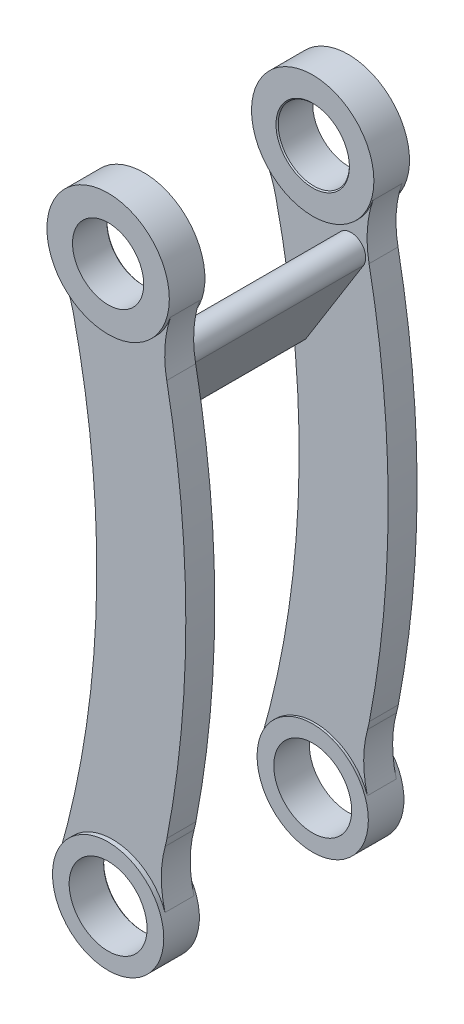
ISO-10303-21;
HEADER;
FILE_DESCRIPTION(('STEP AP214'),'2;1');
FILE_NAME('part.step','',(''),(''),'','','');
FILE_SCHEMA(('AUTOMOTIVE_DESIGN { 1 0 10303 214 1 1 1 1 }'));
ENDSEC;
DATA;
#1=APPLICATION_CONTEXT('core data for automotive mechanical design processes');
#2=APPLICATION_PROTOCOL_DEFINITION('international standard','automotive_design',2000,#1);
#3=PRODUCT_CONTEXT('',#1,'mechanical');
#4=PRODUCT('Part','Part','',(#3));
#5=PRODUCT_RELATED_PRODUCT_CATEGORY('part','',(#4));
#6=PRODUCT_DEFINITION_FORMATION('','',#4);
#7=PRODUCT_DEFINITION_CONTEXT('part definition',#1,'design');
#8=PRODUCT_DEFINITION('design','',#6,#7);
#9=PRODUCT_DEFINITION_SHAPE('','',#8);
#10=(LENGTH_UNIT() NAMED_UNIT(*) SI_UNIT(.MILLI.,.METRE.));
#11=(NAMED_UNIT(*) PLANE_ANGLE_UNIT() SI_UNIT($,.RADIAN.));
#12=(NAMED_UNIT(*) SI_UNIT($,.STERADIAN.) SOLID_ANGLE_UNIT());
#13=UNCERTAINTY_MEASURE_WITH_UNIT(LENGTH_MEASURE(1.E-05),#10,'distance_accuracy_value','');
#14=(GEOMETRIC_REPRESENTATION_CONTEXT(3) GLOBAL_UNCERTAINTY_ASSIGNED_CONTEXT((#13)) GLOBAL_UNIT_ASSIGNED_CONTEXT((#10,
#11,#12)) REPRESENTATION_CONTEXT('',''));
#15=CARTESIAN_POINT('',(0.,0.,0.));
#16=DIRECTION('',(0.,0.,1.));
#17=DIRECTION('',(1.,0.,0.));
#18=AXIS2_PLACEMENT_3D('',#15,#16,#17);
#19=CARTESIAN_POINT('',(-251.75789418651,98.2298007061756,103.92));
#20=DIRECTION('',(0.,0.,1.));
#21=DIRECTION('',(1.,0.,0.));
#22=AXIS2_PLACEMENT_3D('',#19,#20,#21);
#23=PLANE('',#22);
#24=CARTESIAN_POINT('',(-437.093638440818,56.3888888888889,103.92));
#25=DIRECTION('',(0.,0.,-1.));
#26=DIRECTION('',(1.,0.,0.));
#27=AXIS2_PLACEMENT_3D('',#24,#25,#26);
#28=CIRCLE('',#27,430.);
#29=CARTESIAN_POINT('',(-17.6495856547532,151.08147879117,103.92));
#30=VERTEX_POINT('',#29);
#31=CARTESIAN_POINT('',(-24.0161339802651,-63.0555555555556,103.92));
#32=VERTEX_POINT('',#31);
#33=EDGE_CURVE('E180',#30,#32,#28,.T.);
#34=ORIENTED_EDGE('',*,*,#33,.T.);
#35=CARTESIAN_POINT('',(-4.44089209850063E-13,-70.,103.92));
#36=DIRECTION('',(0.,0.,1.));
#37=DIRECTION('',(1.,0.,0.));
#38=AXIS2_PLACEMENT_3D('',#35,#36,#37);
#39=CIRCLE('',#38,25.);
#40=CARTESIAN_POINT('',(23.575093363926,-61.6804463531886,103.92));
#41=VERTEX_POINT('',#40);
#42=EDGE_CURVE('E187',#41,#32,#39,.T.);
#43=ORIENTED_EDGE('',*,*,#42,.F.);
#44=CARTESIAN_POINT('',(71.9167906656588,-48.9101565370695,103.92));
#45=DIRECTION('',(0.,0.,-1.));
#46=DIRECTION('',(1.,0.,0.));
#47=AXIS2_PLACEMENT_3D('',#44,#45,#46);
#48=CIRCLE('',#47,50.);
#49=CARTESIAN_POINT('',(23.6300135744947,-35.9337487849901,103.92));
#50=VERTEX_POINT('',#49);
#51=EDGE_CURVE('E169',#41,#50,#48,.T.);
#52=ORIENTED_EDGE('',*,*,#51,.T.);
#53=CARTESIAN_POINT('',(-24.6567635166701,-22.9573410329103,103.92));
#54=DIRECTION('',(0.,0.,1.));
#55=DIRECTION('',(1.,0.,0.));
#56=AXIS2_PLACEMENT_3D('',#53,#54,#55);
#57=CIRCLE('',#56,50.);
#58=CARTESIAN_POINT('',(24.4428644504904,-32.4033207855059,103.92));
#59=VERTEX_POINT('',#58);
#60=EDGE_CURVE('E179',#50,#59,#57,.T.);
#61=ORIENTED_EDGE('',*,*,#60,.T.);
#62=CARTESIAN_POINT('',(-437.093638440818,56.3888888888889,103.92));
#63=DIRECTION('',(0.,0.,1.));
#64=DIRECTION('',(1.,0.,0.));
#65=AXIS2_PLACEMENT_3D('',#62,#63,#64);
#66=CIRCLE('',#65,470.);
#67=CARTESIAN_POINT('',(24.3406091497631,145.710975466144,103.92));
#68=VERTEX_POINT('',#67);
#69=EDGE_CURVE('E229',#59,#68,#66,.T.);
#70=ORIENTED_EDGE('',*,*,#69,.T.);
#71=CARTESIAN_POINT('',(73.4293588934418,155.213325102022,103.92));
#72=DIRECTION('',(0.,0.,-1.));
#73=DIRECTION('',(-1.,0.,0.));
#74=AXIS2_PLACEMENT_3D('',#71,#72,#73);
#75=CIRCLE('',#74,50.);
#76=CARTESIAN_POINT('',(26.0555789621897,171.204728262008,103.92));
#77=VERTEX_POINT('',#76);
#78=EDGE_CURVE('E219',#68,#77,#75,.T.);
#79=ORIENTED_EDGE('',*,*,#78,.T.);
#80=CARTESIAN_POINT('',(0.,180.,103.92));
#81=DIRECTION('',(0.,0.,1.));
#82=DIRECTION('',(1.,0.,0.));
#83=AXIS2_PLACEMENT_3D('',#80,#81,#82);
#84=CIRCLE('',#83,27.5);
#85=CARTESIAN_POINT('',(-23.5691499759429,165.831543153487,103.92));
#86=VERTEX_POINT('',#85);
#87=EDGE_CURVE('E197',#86,#77,#84,.T.);
#88=ORIENTED_EDGE('',*,*,#87,.F.);
#89=CARTESIAN_POINT('',(-66.4221499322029,140.070712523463,103.92));
#90=DIRECTION('',(0.,0.,-1.));
#91=DIRECTION('',(1.,0.,0.));
#92=AXIS2_PLACEMENT_3D('',#89,#90,#91);
#93=CIRCLE('',#92,50.);
#94=EDGE_CURVE('E216',#86,#30,#93,.T.);
#95=ORIENTED_EDGE('',*,*,#94,.T.);
#96=EDGE_LOOP('',(#34,#43,#52,#61,#70,#79,#88,#95));
#97=FACE_BOUND('',#96,.T.);
#98=ADVANCED_FACE('F32',(#97),#23,.T.);
#99=CARTESIAN_POINT('',(-251.75789418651,98.2298007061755,90.9200000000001));
#100=DIRECTION('',(0.,0.,1.));
#101=DIRECTION('',(1.,0.,0.));
#102=AXIS2_PLACEMENT_3D('',#99,#100,#101);
#103=PLANE('',#102);
#104=DIRECTION('',(-0.400474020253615,-0.916308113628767,0.));
#105=VECTOR('',#104,1.);
#106=CARTESIAN_POINT('',(10.232997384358,149.874023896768,90.9200000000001));
#107=LINE('',#106,#105);
#108=CARTESIAN_POINT('',(10.232997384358,149.874023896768,90.9200000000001));
#109=VERTEX_POINT('',#108);
#110=CARTESIAN_POINT('',(-9.3186853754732,105.138623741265,90.9200000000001));
#111=VERTEX_POINT('',#110);
#112=EDGE_CURVE('E523',#109,#111,#107,.T.);
#113=ORIENTED_EDGE('',*,*,#112,.T.);
#114=CARTESIAN_POINT('',(-6.56976103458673,103.937201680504,90.9199999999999));
#115=DIRECTION('',(0.,0.,1.));
#116=DIRECTION('',(-1.,0.,0.));
#117=AXIS2_PLACEMENT_3D('',#114,#115,#116);
#118=CIRCLE('',#117,3.00000000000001);
#119=CARTESIAN_POINT('',(-4.02475261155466,102.34882762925,90.92));
#120=VERTEX_POINT('',#119);
#121=EDGE_CURVE('E514',#111,#120,#118,.T.);
#122=ORIENTED_EDGE('',*,*,#121,.T.);
#123=DIRECTION('',(0.529458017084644,0.848336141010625,0.));
#124=VECTOR('',#123,1.);
#125=CARTESIAN_POINT('',(21.8241031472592,143.765744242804,90.9200000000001));
#126=LINE('',#125,#124);
#127=CARTESIAN_POINT('',(21.8241031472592,143.765744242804,90.9200000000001));
#128=VERTEX_POINT('',#127);
#129=EDGE_CURVE('E517',#120,#128,#126,.T.);
#130=ORIENTED_EDGE('',*,*,#129,.T.);
#131=CARTESIAN_POINT('',(16.2517879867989,147.243501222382,90.9200000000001));
#132=DIRECTION('',(0.,0.,1.));
#133=DIRECTION('',(1.,0.,0.));
#134=AXIS2_PLACEMENT_3D('',#131,#132,#133);
#135=CIRCLE('',#134,6.56852265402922);
#136=EDGE_CURVE('E520',#128,#109,#135,.T.);
#137=ORIENTED_EDGE('',*,*,#136,.T.);
#138=EDGE_LOOP('',(#113,#122,#130,#137));
#139=FACE_BOUND('',#138,.T.);
#140=CARTESIAN_POINT('',(-4.44089209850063E-13,-70.,90.9200000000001));
#141=DIRECTION('',(0.,0.,-1.));
#142=DIRECTION('',(-1.,0.,0.));
#143=AXIS2_PLACEMENT_3D('',#140,#141,#142);
#144=CIRCLE('',#143,25.);
#145=CARTESIAN_POINT('',(-24.0161339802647,-63.0555555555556,90.9199999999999));
#146=VERTEX_POINT('',#145);
#147=CARTESIAN_POINT('',(23.5750933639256,-61.6804463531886,90.9200000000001));
#148=VERTEX_POINT('',#147);
#149=EDGE_CURVE('E188',#146,#148,#144,.T.);
#150=ORIENTED_EDGE('',*,*,#149,.F.);
#151=CARTESIAN_POINT('',(-437.093638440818,56.388888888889,90.9200000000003));
#152=DIRECTION('',(0.,0.,-1.));
#153=DIRECTION('',(1.,0.,0.));
#154=AXIS2_PLACEMENT_3D('',#151,#152,#153);
#155=CIRCLE('',#154,430.);
#156=CARTESIAN_POINT('',(-17.6495856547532,151.081478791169,90.92));
#157=VERTEX_POINT('',#156);
#158=EDGE_CURVE('E549',#157,#146,#155,.T.);
#159=ORIENTED_EDGE('',*,*,#158,.F.);
#160=CARTESIAN_POINT('',(-66.4221499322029,140.070712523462,90.9200000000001));
#161=DIRECTION('',(0.,0.,-1.));
#162=DIRECTION('',(1.,0.,0.));
#163=AXIS2_PLACEMENT_3D('',#160,#161,#162);
#164=CIRCLE('',#163,50.);
#165=CARTESIAN_POINT('',(-23.5691499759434,165.831543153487,90.9199999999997));
#166=VERTEX_POINT('',#165);
#167=EDGE_CURVE('E570',#166,#157,#164,.T.);
#168=ORIENTED_EDGE('',*,*,#167,.F.);
#169=CARTESIAN_POINT('',(-2.22044604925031E-13,180.,90.92));
#170=DIRECTION('',(0.,0.,-1.));
#171=DIRECTION('',(-1.,0.,0.));
#172=AXIS2_PLACEMENT_3D('',#169,#170,#171);
#173=CIRCLE('',#172,27.5);
#174=CARTESIAN_POINT('',(26.0555789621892,171.204728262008,90.9199999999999));
#175=VERTEX_POINT('',#174);
#176=EDGE_CURVE('E560',#175,#166,#173,.T.);
#177=ORIENTED_EDGE('',*,*,#176,.F.);
#178=CARTESIAN_POINT('',(73.429358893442,155.213325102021,90.9200000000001));
#179=DIRECTION('',(0.,0.,-1.));
#180=DIRECTION('',(-1.,0.,0.));
#181=AXIS2_PLACEMENT_3D('',#178,#179,#180);
#182=CIRCLE('',#181,50.);
#183=CARTESIAN_POINT('',(24.3406091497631,145.710975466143,90.9200000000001));
#184=VERTEX_POINT('',#183);
#185=EDGE_CURVE('E567',#184,#175,#182,.T.);
#186=ORIENTED_EDGE('',*,*,#185,.F.);
#187=CARTESIAN_POINT('',(-437.093638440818,56.388888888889,90.9200000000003));
#188=DIRECTION('',(0.,0.,1.));
#189=DIRECTION('',(1.,0.,0.));
#190=AXIS2_PLACEMENT_3D('',#187,#188,#189);
#191=CIRCLE('',#190,470.);
#192=CARTESIAN_POINT('',(24.4428644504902,-32.4033207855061,90.92));
#193=VERTEX_POINT('',#192);
#194=EDGE_CURVE('E565',#193,#184,#191,.T.);
#195=ORIENTED_EDGE('',*,*,#194,.F.);
#196=CARTESIAN_POINT('',(-24.6567635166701,-22.9573410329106,90.9200000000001));
#197=DIRECTION('',(0.,0.,1.));
#198=DIRECTION('',(1.,0.,0.));
#199=AXIS2_PLACEMENT_3D('',#196,#197,#198);
#200=CIRCLE('',#199,50.);
#201=CARTESIAN_POINT('',(23.6300135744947,-35.93374878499,90.9200000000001));
#202=VERTEX_POINT('',#201);
#203=EDGE_CURVE('E557',#202,#193,#200,.T.);
#204=ORIENTED_EDGE('',*,*,#203,.F.);
#205=CARTESIAN_POINT('',(71.9167906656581,-48.9101565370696,90.9200000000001));
#206=DIRECTION('',(0.,0.,-1.));
#207=DIRECTION('',(1.,0.,0.));
#208=AXIS2_PLACEMENT_3D('',#205,#206,#207);
#209=CIRCLE('',#208,50.);
#210=EDGE_CURVE('E551',#148,#202,#209,.T.);
#211=ORIENTED_EDGE('',*,*,#210,.F.);
#212=EDGE_LOOP('',(#150,#159,#168,#177,#186,#195,#204,#211));
#213=FACE_BOUND('',#212,.T.);
#214=ADVANCED_FACE('F261',(#139,#213),#103,.F.);
#215=CARTESIAN_POINT('',(-251.757894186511,98.2298007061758,12.9999999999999));
#216=DIRECTION('',(0.,0.,1.));
#217=DIRECTION('',(1.,0.,0.));
#218=AXIS2_PLACEMENT_3D('',#215,#216,#217);
#219=PLANE('',#218);
#220=CARTESIAN_POINT('',(-437.093638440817,56.3888888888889,13.));
#221=DIRECTION('',(0.,0.,-1.));
#222=DIRECTION('',(1.,0.,0.));
#223=AXIS2_PLACEMENT_3D('',#220,#221,#222);
#224=CIRCLE('',#223,430.);
#225=CARTESIAN_POINT('',(-17.6495856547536,151.08147879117,13.0000000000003));
#226=VERTEX_POINT('',#225);
#227=CARTESIAN_POINT('',(-24.0161339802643,-63.0555555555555,12.9999999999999));
#228=VERTEX_POINT('',#227);
#229=EDGE_CURVE('E476',#226,#228,#224,.T.);
#230=ORIENTED_EDGE('',*,*,#229,.T.);
#231=CARTESIAN_POINT('',(0.,-70.0000000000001,12.9999999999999));
#232=DIRECTION('',(0.,0.,1.));
#233=DIRECTION('',(1.,0.,0.));
#234=AXIS2_PLACEMENT_3D('',#231,#232,#233);
#235=CIRCLE('',#234,25.);
#236=CARTESIAN_POINT('',(23.575093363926,-61.6804463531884,13.0000000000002));
#237=VERTEX_POINT('',#236);
#238=EDGE_CURVE('E389',#237,#228,#235,.T.);
#239=ORIENTED_EDGE('',*,*,#238,.F.);
#240=CARTESIAN_POINT('',(71.9167906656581,-48.9101565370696,13.0000000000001));
#241=DIRECTION('',(0.,0.,-1.));
#242=DIRECTION('',(1.,0.,0.));
#243=AXIS2_PLACEMENT_3D('',#240,#241,#242);
#244=CIRCLE('',#243,50.);
#245=CARTESIAN_POINT('',(23.6300135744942,-35.93374878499,13.0000000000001));
#246=VERTEX_POINT('',#245);
#247=EDGE_CURVE('E474',#237,#246,#244,.T.);
#248=ORIENTED_EDGE('',*,*,#247,.T.);
#249=CARTESIAN_POINT('',(-24.6567635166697,-22.9573410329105,13.0000000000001));
#250=DIRECTION('',(0.,0.,1.));
#251=DIRECTION('',(1.,0.,0.));
#252=AXIS2_PLACEMENT_3D('',#249,#250,#251);
#253=CIRCLE('',#252,50.);
#254=CARTESIAN_POINT('',(24.4428644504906,-32.403320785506,13.));
#255=VERTEX_POINT('',#254);
#256=EDGE_CURVE('E472',#246,#255,#253,.T.);
#257=ORIENTED_EDGE('',*,*,#256,.T.);
#258=CARTESIAN_POINT('',(-437.093638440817,56.3888888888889,13.));
#259=DIRECTION('',(0.,0.,1.));
#260=DIRECTION('',(1.,0.,0.));
#261=AXIS2_PLACEMENT_3D('',#258,#259,#260);
#262=CIRCLE('',#261,470.);
#263=CARTESIAN_POINT('',(24.3406091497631,145.710975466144,13.0000000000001));
#264=VERTEX_POINT('',#263);
#265=EDGE_CURVE('E455',#255,#264,#262,.T.);
#266=ORIENTED_EDGE('',*,*,#265,.T.);
#267=CARTESIAN_POINT('',(73.429358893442,155.213325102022,13.0000000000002));
#268=DIRECTION('',(0.,0.,-1.));
#269=DIRECTION('',(-1.,0.,0.));
#270=AXIS2_PLACEMENT_3D('',#267,#268,#269);
#271=CIRCLE('',#270,50.);
#272=CARTESIAN_POINT('',(26.0555789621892,171.204728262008,12.9999999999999));
#273=VERTEX_POINT('',#272);
#274=EDGE_CURVE('E445',#264,#273,#271,.T.);
#275=ORIENTED_EDGE('',*,*,#274,.T.);
#276=CARTESIAN_POINT('',(-4.44089209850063E-13,180.,13.));
#277=DIRECTION('',(0.,0.,1.));
#278=DIRECTION('',(1.,0.,0.));
#279=AXIS2_PLACEMENT_3D('',#276,#277,#278);
#280=CIRCLE('',#279,27.5);
#281=CARTESIAN_POINT('',(-23.5691499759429,165.831543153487,13.0000000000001));
#282=VERTEX_POINT('',#281);
#283=EDGE_CURVE('E432',#282,#273,#280,.T.);
#284=ORIENTED_EDGE('',*,*,#283,.F.);
#285=CARTESIAN_POINT('',(-66.4221499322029,140.070712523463,12.9999999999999));
#286=DIRECTION('',(0.,0.,-1.));
#287=DIRECTION('',(1.,0.,0.));
#288=AXIS2_PLACEMENT_3D('',#285,#286,#287);
#289=CIRCLE('',#288,50.);
#290=EDGE_CURVE('E55',#282,#226,#289,.T.);
#291=ORIENTED_EDGE('',*,*,#290,.T.);
#292=EDGE_LOOP('',(#230,#239,#248,#257,#266,#275,#284,#291));
#293=FACE_BOUND('',#292,.T.);
#294=DIRECTION('',(0.529458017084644,0.848336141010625,0.));
#295=VECTOR('',#294,1.);
#296=CARTESIAN_POINT('',(21.8241031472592,143.765744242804,13.0000000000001));
#297=LINE('',#296,#295);
#298=CARTESIAN_POINT('',(-4.02475261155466,102.34882762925,12.9999999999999));
#299=VERTEX_POINT('',#298);
#300=CARTESIAN_POINT('',(21.8241031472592,143.765744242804,13.0000000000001));
#301=VERTEX_POINT('',#300);
#302=EDGE_CURVE('E501',#299,#301,#297,.T.);
#303=ORIENTED_EDGE('',*,*,#302,.F.);
#304=CARTESIAN_POINT('',(-6.56976103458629,103.937201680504,13.));
#305=DIRECTION('',(0.,0.,1.));
#306=DIRECTION('',(-1.,0.,0.));
#307=AXIS2_PLACEMENT_3D('',#304,#305,#306);
#308=CIRCLE('',#307,3.00000000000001);
#309=CARTESIAN_POINT('',(-9.31868537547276,105.138623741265,13.0000000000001));
#310=VERTEX_POINT('',#309);
#311=EDGE_CURVE('E504',#310,#299,#308,.T.);
#312=ORIENTED_EDGE('',*,*,#311,.F.);
#313=DIRECTION('',(-0.400474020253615,-0.916308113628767,0.));
#314=VECTOR('',#313,1.);
#315=CARTESIAN_POINT('',(10.2329973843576,149.874023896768,13.0000000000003));
#316=LINE('',#315,#314);
#317=CARTESIAN_POINT('',(10.2329973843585,149.874023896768,13.0000000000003));
#318=VERTEX_POINT('',#317);
#319=EDGE_CURVE('E508',#318,#310,#316,.T.);
#320=ORIENTED_EDGE('',*,*,#319,.F.);
#321=CARTESIAN_POINT('',(16.2517879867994,147.243501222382,13.0000000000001));
#322=DIRECTION('',(0.,0.,1.));
#323=DIRECTION('',(1.,0.,0.));
#324=AXIS2_PLACEMENT_3D('',#321,#322,#323);
#325=CIRCLE('',#324,6.56852265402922);
#326=EDGE_CURVE('E505',#301,#318,#325,.T.);
#327=ORIENTED_EDGE('',*,*,#326,.F.);
#328=EDGE_LOOP('',(#303,#312,#320,#327));
#329=FACE_BOUND('',#328,.T.);
#330=ADVANCED_FACE('F266',(#293,#329),#219,.T.);
#331=CARTESIAN_POINT('',(-251.757894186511,98.2298007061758,0.));
#332=DIRECTION('',(0.,0.,1.));
#333=DIRECTION('',(1.,0.,0.));
#334=AXIS2_PLACEMENT_3D('',#331,#332,#333);
#335=PLANE('',#334);
#336=CARTESIAN_POINT('',(0.,180.,0.));
#337=DIRECTION('',(0.,0.,-1.));
#338=DIRECTION('',(-1.,0.,0.));
#339=AXIS2_PLACEMENT_3D('',#336,#337,#338);
#340=CIRCLE('',#339,27.5);
#341=CARTESIAN_POINT('',(26.0555789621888,171.204728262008,0.));
#342=VERTEX_POINT('',#341);
#343=CARTESIAN_POINT('',(-23.5691499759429,165.831543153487,2.22044604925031E-13));
#344=VERTEX_POINT('',#343);
#345=EDGE_CURVE('E491',#342,#344,#340,.T.);
#346=ORIENTED_EDGE('',*,*,#345,.F.);
#347=CARTESIAN_POINT('',(73.429358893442,155.213325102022,0.));
#348=DIRECTION('',(0.,0.,-1.));
#349=DIRECTION('',(-1.,0.,0.));
#350=AXIS2_PLACEMENT_3D('',#347,#348,#349);
#351=CIRCLE('',#350,50.);
#352=CARTESIAN_POINT('',(24.3406091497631,145.710975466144,0.));
#353=VERTEX_POINT('',#352);
#354=EDGE_CURVE('E480',#353,#342,#351,.T.);
#355=ORIENTED_EDGE('',*,*,#354,.F.);
#356=CARTESIAN_POINT('',(-437.093638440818,56.3888888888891,1.11022302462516E-13));
#357=DIRECTION('',(0.,0.,1.));
#358=DIRECTION('',(1.,0.,0.));
#359=AXIS2_PLACEMENT_3D('',#356,#357,#358);
#360=CIRCLE('',#359,470.);
#361=CARTESIAN_POINT('',(24.4428644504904,-32.4033207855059,0.));
#362=VERTEX_POINT('',#361);
#363=EDGE_CURVE('E481',#362,#353,#360,.T.);
#364=ORIENTED_EDGE('',*,*,#363,.F.);
#365=CARTESIAN_POINT('',(-24.6567635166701,-22.9573410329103,0.));
#366=DIRECTION('',(0.,0.,1.));
#367=DIRECTION('',(1.,0.,0.));
#368=AXIS2_PLACEMENT_3D('',#365,#366,#367);
#369=CIRCLE('',#368,50.);
#370=CARTESIAN_POINT('',(23.630013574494,-35.9337487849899,0.));
#371=VERTEX_POINT('',#370);
#372=EDGE_CURVE('E412',#371,#362,#369,.T.);
#373=ORIENTED_EDGE('',*,*,#372,.F.);
#374=CARTESIAN_POINT('',(71.9167906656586,-48.9101565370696,1.11022302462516E-13));
#375=DIRECTION('',(0.,0.,-1.));
#376=DIRECTION('',(1.,0.,0.));
#377=AXIS2_PLACEMENT_3D('',#374,#375,#376);
#378=CIRCLE('',#377,50.);
#379=CARTESIAN_POINT('',(23.575093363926,-61.6804463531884,0.));
#380=VERTEX_POINT('',#379);
#381=EDGE_CURVE('E410',#380,#371,#378,.T.);
#382=ORIENTED_EDGE('',*,*,#381,.F.);
#383=CARTESIAN_POINT('',(-4.44089209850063E-13,-70.0000000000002,0.));
#384=DIRECTION('',(0.,0.,-1.));
#385=DIRECTION('',(-1.,0.,0.));
#386=AXIS2_PLACEMENT_3D('',#383,#384,#385);
#387=CIRCLE('',#386,25.);
#388=CARTESIAN_POINT('',(-24.0161339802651,-63.0555555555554,1.11022302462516E-13));
#389=VERTEX_POINT('',#388);
#390=EDGE_CURVE('E390',#389,#380,#387,.T.);
#391=ORIENTED_EDGE('',*,*,#390,.F.);
#392=CARTESIAN_POINT('',(-437.093638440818,56.3888888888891,1.11022302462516E-13));
#393=DIRECTION('',(0.,0.,-1.));
#394=DIRECTION('',(1.,0.,0.));
#395=AXIS2_PLACEMENT_3D('',#392,#393,#394);
#396=CIRCLE('',#395,430.);
#397=CARTESIAN_POINT('',(-17.6495856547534,151.08147879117,2.22044604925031E-13));
#398=VERTEX_POINT('',#397);
#399=EDGE_CURVE('E413',#398,#389,#396,.T.);
#400=ORIENTED_EDGE('',*,*,#399,.F.);
#401=CARTESIAN_POINT('',(-66.4221499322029,140.070712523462,0.));
#402=DIRECTION('',(0.,0.,-1.));
#403=DIRECTION('',(1.,0.,0.));
#404=AXIS2_PLACEMENT_3D('',#401,#402,#403);
#405=CIRCLE('',#404,50.);
#406=EDGE_CURVE('E478',#344,#398,#405,.T.);
#407=ORIENTED_EDGE('',*,*,#406,.F.);
#408=EDGE_LOOP('',(#346,#355,#364,#373,#382,#391,#400,#407));
#409=FACE_BOUND('',#408,.T.);
#410=ADVANCED_FACE('F340',(#409),#335,.F.);
#411=CARTESIAN_POINT('',(-437.093638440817,56.3888888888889,13.));
#412=DIRECTION('',(0.,0.,-1.));
#413=DIRECTION('',(-1.,0.,0.));
#414=AXIS2_PLACEMENT_3D('',#411,#412,#413);
#415=CYLINDRICAL_SURFACE('',#414,430.);
#416=ORIENTED_EDGE('',*,*,#399,.T.);
#417=DIRECTION('',(0.,0.,-1.));
#418=VECTOR('',#417,1.);
#419=CARTESIAN_POINT('',(-24.0161339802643,-63.0555555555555,12.9999999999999));
#420=LINE('',#419,#418);
#421=EDGE_CURVE('E379',#228,#389,#420,.T.);
#422=ORIENTED_EDGE('',*,*,#421,.F.);
#423=ORIENTED_EDGE('',*,*,#229,.F.);
#424=DIRECTION('',(0.,0.,-1.));
#425=VECTOR('',#424,1.);
#426=CARTESIAN_POINT('',(-17.6495856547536,151.08147879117,13.0000000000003));
#427=LINE('',#426,#425);
#428=EDGE_CURVE('E444',#226,#398,#427,.T.);
#429=ORIENTED_EDGE('',*,*,#428,.T.);
#430=EDGE_LOOP('',(#416,#422,#423,#429));
#431=FACE_BOUND('',#430,.T.);
#432=ADVANCED_FACE('F34',(#431),#415,.F.);
#433=CARTESIAN_POINT('',(0.,-70.0000000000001,12.9999999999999));
#434=DIRECTION('',(0.,0.,-1.));
#435=DIRECTION('',(-1.,0.,0.));
#436=AXIS2_PLACEMENT_3D('',#433,#434,#435);
#437=CYLINDRICAL_SURFACE('',#436,25.);
#438=ORIENTED_EDGE('',*,*,#421,.T.);
#439=ORIENTED_EDGE('',*,*,#390,.T.);
#440=DIRECTION('',(0.,0.,-1.));
#441=VECTOR('',#440,1.);
#442=CARTESIAN_POINT('',(23.575093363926,-61.6804463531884,13.0000000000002));
#443=LINE('',#442,#441);
#444=EDGE_CURVE('E404',#237,#380,#443,.T.);
#445=ORIENTED_EDGE('',*,*,#444,.F.);
#446=ORIENTED_EDGE('',*,*,#238,.T.);
#447=EDGE_LOOP('',(#438,#439,#445,#446));
#448=FACE_BOUND('',#447,.T.);
#449=CARTESIAN_POINT('',(0.,-70.0000000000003,14.));
#450=DIRECTION('',(0.,0.,1.));
#451=DIRECTION('',(1.,0.,0.));
#452=AXIS2_PLACEMENT_3D('',#449,#450,#451);
#453=CIRCLE('',#452,25.);
#454=CARTESIAN_POINT('',(25.0000000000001,-70.0000000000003,14.));
#455=VERTEX_POINT('',#454);
#456=EDGE_CURVE('E384',#455,#455,#453,.T.);
#457=ORIENTED_EDGE('',*,*,#456,.F.);
#458=EDGE_LOOP('',(#457));
#459=FACE_BOUND('',#458,.T.);
#460=CARTESIAN_POINT('',(0.,-70.0000000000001,-2.));
#461=DIRECTION('',(0.,0.,-1.));
#462=DIRECTION('',(-1.,0.,0.));
#463=AXIS2_PLACEMENT_3D('',#460,#461,#462);
#464=CIRCLE('',#463,25.);
#465=CARTESIAN_POINT('',(-25.0000000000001,-70.0000000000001,-2.));
#466=VERTEX_POINT('',#465);
#467=EDGE_CURVE('E387',#466,#466,#464,.T.);
#468=ORIENTED_EDGE('',*,*,#467,.F.);
#469=EDGE_LOOP('',(#468));
#470=FACE_BOUND('',#469,.T.);
#471=ADVANCED_FACE('F367',(#448,#459,#470),#437,.T.);
#472=CARTESIAN_POINT('',(71.9167906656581,-48.9101565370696,13.0000000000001));
#473=DIRECTION('',(0.,0.,-1.));
#474=DIRECTION('',(-1.,0.,0.));
#475=AXIS2_PLACEMENT_3D('',#472,#473,#474);
#476=CYLINDRICAL_SURFACE('',#475,50.);
#477=ORIENTED_EDGE('',*,*,#381,.T.);
#478=DIRECTION('',(0.,0.,-1.));
#479=VECTOR('',#478,1.);
#480=CARTESIAN_POINT('',(23.6300135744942,-35.93374878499,13.0000000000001));
#481=LINE('',#480,#479);
#482=EDGE_CURVE('E407',#246,#371,#481,.T.);
#483=ORIENTED_EDGE('',*,*,#482,.F.);
#484=ORIENTED_EDGE('',*,*,#247,.F.);
#485=ORIENTED_EDGE('',*,*,#444,.T.);
#486=EDGE_LOOP('',(#477,#483,#484,#485));
#487=FACE_BOUND('',#486,.T.);
#488=ADVANCED_FACE('F364',(#487),#476,.F.);
#489=CARTESIAN_POINT('',(-24.6567635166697,-22.9573410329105,13.0000000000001));
#490=DIRECTION('',(0.,0.,-1.));
#491=DIRECTION('',(-1.,0.,0.));
#492=AXIS2_PLACEMENT_3D('',#489,#490,#491);
#493=CYLINDRICAL_SURFACE('',#492,50.);
#494=ORIENTED_EDGE('',*,*,#372,.T.);
#495=DIRECTION('',(0.,0.,-1.));
#496=VECTOR('',#495,1.);
#497=CARTESIAN_POINT('',(24.4428644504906,-32.403320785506,13.));
#498=LINE('',#497,#496);
#499=EDGE_CURVE('E461',#255,#362,#498,.T.);
#500=ORIENTED_EDGE('',*,*,#499,.F.);
#501=ORIENTED_EDGE('',*,*,#256,.F.);
#502=ORIENTED_EDGE('',*,*,#482,.T.);
#503=EDGE_LOOP('',(#494,#500,#501,#502));
#504=FACE_BOUND('',#503,.T.);
#505=ADVANCED_FACE('F360',(#504),#493,.T.);
#506=CARTESIAN_POINT('',(-437.093638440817,56.3888888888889,13.));
#507=DIRECTION('',(0.,0.,-1.));
#508=DIRECTION('',(-1.,0.,0.));
#509=AXIS2_PLACEMENT_3D('',#506,#507,#508);
#510=CYLINDRICAL_SURFACE('',#509,470.);
#511=ORIENTED_EDGE('',*,*,#363,.T.);
#512=DIRECTION('',(0.,0.,-1.));
#513=VECTOR('',#512,1.);
#514=CARTESIAN_POINT('',(24.3406091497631,145.710975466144,13.0000000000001));
#515=LINE('',#514,#513);
#516=EDGE_CURVE('E458',#264,#353,#515,.T.);
#517=ORIENTED_EDGE('',*,*,#516,.F.);
#518=ORIENTED_EDGE('',*,*,#265,.F.);
#519=ORIENTED_EDGE('',*,*,#499,.T.);
#520=EDGE_LOOP('',(#511,#517,#518,#519));
#521=FACE_BOUND('',#520,.T.);
#522=ADVANCED_FACE('F356',(#521),#510,.T.);
#523=CARTESIAN_POINT('',(73.429358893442,155.213325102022,13.0000000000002));
#524=DIRECTION('',(0.,0.,-1.));
#525=DIRECTION('',(-1.,0.,0.));
#526=AXIS2_PLACEMENT_3D('',#523,#524,#525);
#527=CYLINDRICAL_SURFACE('',#526,50.);
#528=ORIENTED_EDGE('',*,*,#354,.T.);
#529=DIRECTION('',(0.,0.,-1.));
#530=VECTOR('',#529,1.);
#531=CARTESIAN_POINT('',(26.0555789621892,171.204728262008,12.9999999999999));
#532=LINE('',#531,#530);
#533=EDGE_CURVE('E451',#273,#342,#532,.T.);
#534=ORIENTED_EDGE('',*,*,#533,.F.);
#535=ORIENTED_EDGE('',*,*,#274,.F.);
#536=ORIENTED_EDGE('',*,*,#516,.T.);
#537=EDGE_LOOP('',(#528,#534,#535,#536));
#538=FACE_BOUND('',#537,.T.);
#539=ADVANCED_FACE('F352',(#538),#527,.F.);
#540=CARTESIAN_POINT('',(-4.44089209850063E-13,180.,13.));
#541=DIRECTION('',(0.,0.,-1.));
#542=DIRECTION('',(-1.,0.,0.));
#543=AXIS2_PLACEMENT_3D('',#540,#541,#542);
#544=CYLINDRICAL_SURFACE('',#543,27.5000000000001);
#545=ORIENTED_EDGE('',*,*,#533,.T.);
#546=ORIENTED_EDGE('',*,*,#345,.T.);
#547=DIRECTION('',(0.,0.,-1.));
#548=VECTOR('',#547,1.);
#549=CARTESIAN_POINT('',(-23.5691499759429,165.831543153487,13.0000000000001));
#550=LINE('',#549,#548);
#551=EDGE_CURVE('E448',#282,#344,#550,.T.);
#552=ORIENTED_EDGE('',*,*,#551,.F.);
#553=ORIENTED_EDGE('',*,*,#283,.T.);
#554=EDGE_LOOP('',(#545,#546,#552,#553));
#555=FACE_BOUND('',#554,.T.);
#556=CARTESIAN_POINT('',(-4.44089209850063E-13,180.,14.));
#557=DIRECTION('',(0.,0.,1.));
#558=DIRECTION('',(1.,0.,0.));
#559=AXIS2_PLACEMENT_3D('',#556,#557,#558);
#560=CIRCLE('',#559,27.5);
#561=CARTESIAN_POINT('',(27.4999999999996,180.,14.));
#562=VERTEX_POINT('',#561);
#563=EDGE_CURVE('E421',#562,#562,#560,.T.);
#564=ORIENTED_EDGE('',*,*,#563,.F.);
#565=EDGE_LOOP('',(#564));
#566=FACE_BOUND('',#565,.T.);
#567=CARTESIAN_POINT('',(0.,180.,-2.));
#568=DIRECTION('',(0.,0.,-1.));
#569=DIRECTION('',(-1.,0.,0.));
#570=AXIS2_PLACEMENT_3D('',#567,#568,#569);
#571=CIRCLE('',#570,27.5);
#572=CARTESIAN_POINT('',(-27.5000000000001,180.,-2.));
#573=VERTEX_POINT('',#572);
#574=EDGE_CURVE('E393',#573,#573,#571,.T.);
#575=ORIENTED_EDGE('',*,*,#574,.F.);
#576=EDGE_LOOP('',(#575));
#577=FACE_BOUND('',#576,.T.);
#578=ADVANCED_FACE('F348',(#555,#566,#577),#544,.T.);
#579=CARTESIAN_POINT('',(-66.4221499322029,140.070712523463,12.9999999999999));
#580=DIRECTION('',(0.,0.,-1.));
#581=DIRECTION('',(-1.,0.,0.));
#582=AXIS2_PLACEMENT_3D('',#579,#580,#581);
#583=CYLINDRICAL_SURFACE('',#582,50.);
#584=ORIENTED_EDGE('',*,*,#406,.T.);
#585=ORIENTED_EDGE('',*,*,#428,.F.);
#586=ORIENTED_EDGE('',*,*,#290,.F.);
#587=ORIENTED_EDGE('',*,*,#551,.T.);
#588=EDGE_LOOP('',(#584,#585,#586,#587));
#589=FACE_BOUND('',#588,.T.);
#590=ADVANCED_FACE('F338',(#589),#583,.F.);
#591=CARTESIAN_POINT('',(-4.44089209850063E-13,180.,14.));
#592=DIRECTION('',(0.,0.,1.));
#593=DIRECTION('',(1.,0.,0.));
#594=AXIS2_PLACEMENT_3D('',#591,#592,#593);
#595=PLANE('',#594);
#596=CARTESIAN_POINT('',(-4.44089209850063E-13,180.,14.));
#597=DIRECTION('',(0.,0.,1.));
#598=DIRECTION('',(1.,0.,0.));
#599=AXIS2_PLACEMENT_3D('',#596,#597,#598);
#600=CIRCLE('',#599,16.5);
#601=CARTESIAN_POINT('',(16.4999999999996,180.,14.));
#602=VERTEX_POINT('',#601);
#603=EDGE_CURVE('E214',#602,#602,#600,.F.);
#604=ORIENTED_EDGE('',*,*,#603,.T.);
#605=EDGE_LOOP('',(#604));
#606=FACE_BOUND('',#605,.T.);
#607=ORIENTED_EDGE('',*,*,#563,.T.);
#608=EDGE_LOOP('',(#607));
#609=FACE_BOUND('',#608,.T.);
#610=ADVANCED_FACE('F334',(#606,#609),#595,.T.);
#611=CARTESIAN_POINT('',(0.,-70.0000000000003,14.));
#612=DIRECTION('',(0.,0.,1.));
#613=DIRECTION('',(1.,0.,0.));
#614=AXIS2_PLACEMENT_3D('',#611,#612,#613);
#615=PLANE('',#614);
#616=CARTESIAN_POINT('',(0.,-70.0000000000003,14.));
#617=DIRECTION('',(0.,0.,1.));
#618=DIRECTION('',(1.,0.,0.));
#619=AXIS2_PLACEMENT_3D('',#616,#617,#618);
#620=CIRCLE('',#619,17.5);
#621=CARTESIAN_POINT('',(17.5,-70.0000000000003,14.));
#622=VERTEX_POINT('',#621);
#623=EDGE_CURVE('E200',#622,#622,#620,.T.);
#624=ORIENTED_EDGE('',*,*,#623,.F.);
#625=EDGE_LOOP('',(#624));
#626=FACE_BOUND('',#625,.T.);
#627=ORIENTED_EDGE('',*,*,#456,.T.);
#628=EDGE_LOOP('',(#627));
#629=FACE_BOUND('',#628,.T.);
#630=ADVANCED_FACE('F330',(#626,#629),#615,.T.);
#631=CARTESIAN_POINT('',(0.,-70.0000000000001,-2.));
#632=DIRECTION('',(0.,0.,-1.));
#633=DIRECTION('',(-1.,0.,0.));
#634=AXIS2_PLACEMENT_3D('',#631,#632,#633);
#635=PLANE('',#634);
#636=CARTESIAN_POINT('',(0.,-70.0000000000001,-2.));
#637=DIRECTION('',(0.,0.,1.));
#638=DIRECTION('',(1.,0.,0.));
#639=AXIS2_PLACEMENT_3D('',#636,#637,#638);
#640=CIRCLE('',#639,17.5);
#641=CARTESIAN_POINT('',(17.5,-70.0000000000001,-2.));
#642=VERTEX_POINT('',#641);
#643=EDGE_CURVE('E676',#642,#642,#640,.T.);
#644=ORIENTED_EDGE('',*,*,#643,.T.);
#645=EDGE_LOOP('',(#644));
#646=FACE_BOUND('',#645,.T.);
#647=ORIENTED_EDGE('',*,*,#467,.T.);
#648=EDGE_LOOP('',(#647));
#649=FACE_BOUND('',#648,.T.);
#650=ADVANCED_FACE('F326',(#646,#649),#635,.T.);
#651=CARTESIAN_POINT('',(0.,180.,-2.));
#652=DIRECTION('',(0.,0.,-1.));
#653=DIRECTION('',(-1.,0.,0.));
#654=AXIS2_PLACEMENT_3D('',#651,#652,#653);
#655=PLANE('',#654);
#656=CARTESIAN_POINT('',(0.,180.,-2.));
#657=DIRECTION('',(0.,0.,1.));
#658=DIRECTION('',(1.,0.,0.));
#659=AXIS2_PLACEMENT_3D('',#656,#657,#658);
#660=CIRCLE('',#659,16.);
#661=CARTESIAN_POINT('',(16.,180.,-2.));
#662=VERTEX_POINT('',#661);
#663=EDGE_CURVE('E534',#662,#662,#660,.T.);
#664=ORIENTED_EDGE('',*,*,#663,.T.);
#665=EDGE_LOOP('',(#664));
#666=FACE_BOUND('',#665,.T.);
#667=ORIENTED_EDGE('',*,*,#574,.T.);
#668=EDGE_LOOP('',(#667));
#669=FACE_BOUND('',#668,.T.);
#670=ADVANCED_FACE('F322',(#666,#669),#655,.T.);
#671=CARTESIAN_POINT('',(0.,180.,-2.));
#672=DIRECTION('',(0.,0.,1.));
#673=DIRECTION('',(1.,0.,0.));
#674=AXIS2_PLACEMENT_3D('',#671,#672,#673);
#675=CYLINDRICAL_SURFACE('',#674,16.);
#676=CARTESIAN_POINT('',(-4.44089209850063E-13,180.,13.5));
#677=DIRECTION('',(0.,0.,1.));
#678=DIRECTION('',(1.,0.,0.));
#679=AXIS2_PLACEMENT_3D('',#676,#677,#678);
#680=CIRCLE('',#679,16.);
#681=CARTESIAN_POINT('',(15.9999999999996,180.,13.5));
#682=VERTEX_POINT('',#681);
#683=EDGE_CURVE('E417',#682,#682,#680,.T.);
#684=ORIENTED_EDGE('',*,*,#683,.T.);
#685=EDGE_LOOP('',(#684));
#686=FACE_BOUND('',#685,.T.);
#687=ORIENTED_EDGE('',*,*,#663,.F.);
#688=EDGE_LOOP('',(#687));
#689=FACE_BOUND('',#688,.T.);
#690=ADVANCED_FACE('F318',(#686,#689),#675,.F.);
#691=CARTESIAN_POINT('',(-6.56976103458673,103.937201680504,90.9199999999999));
#692=DIRECTION('',(0.,0.,-1.));
#693=DIRECTION('',(-1.,0.,0.));
#694=AXIS2_PLACEMENT_3D('',#691,#692,#693);
#695=CYLINDRICAL_SURFACE('',#694,3.00000000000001);
#696=ORIENTED_EDGE('',*,*,#311,.T.);
#697=DIRECTION('',(0.,0.,-1.));
#698=VECTOR('',#697,1.);
#699=CARTESIAN_POINT('',(-4.02475261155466,102.34882762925,90.92));
#700=LINE('',#699,#698);
#701=EDGE_CURVE('E532',#120,#299,#700,.T.);
#702=ORIENTED_EDGE('',*,*,#701,.F.);
#703=ORIENTED_EDGE('',*,*,#121,.F.);
#704=DIRECTION('',(0.,0.,-1.));
#705=VECTOR('',#704,1.);
#706=CARTESIAN_POINT('',(-9.3186853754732,105.138623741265,90.9200000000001));
#707=LINE('',#706,#705);
#708=EDGE_CURVE('E526',#111,#310,#707,.T.);
#709=ORIENTED_EDGE('',*,*,#708,.T.);
#710=EDGE_LOOP('',(#696,#702,#703,#709));
#711=FACE_BOUND('',#710,.T.);
#712=ADVANCED_FACE('F314',(#711),#695,.T.);
#713=CARTESIAN_POINT('',(21.8241031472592,143.765744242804,90.9200000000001));
#714=DIRECTION('',(-0.848336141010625,0.529458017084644,0.));
#715=DIRECTION('',(-0.529458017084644,-0.848336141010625,0.));
#716=AXIS2_PLACEMENT_3D('',#713,#714,#715);
#717=PLANE('',#716);
#718=ORIENTED_EDGE('',*,*,#302,.T.);
#719=DIRECTION('',(0.,0.,-1.));
#720=VECTOR('',#719,1.);
#721=CARTESIAN_POINT('',(21.8241031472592,143.765744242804,90.9200000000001));
#722=LINE('',#721,#720);
#723=EDGE_CURVE('E530',#128,#301,#722,.T.);
#724=ORIENTED_EDGE('',*,*,#723,.F.);
#725=ORIENTED_EDGE('',*,*,#129,.F.);
#726=ORIENTED_EDGE('',*,*,#701,.T.);
#727=EDGE_LOOP('',(#718,#724,#725,#726));
#728=FACE_BOUND('',#727,.T.);
#729=ADVANCED_FACE('F310',(#728),#717,.F.);
#730=CARTESIAN_POINT('',(16.2517879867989,147.243501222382,90.9200000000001));
#731=DIRECTION('',(0.,0.,-1.));
#732=DIRECTION('',(-1.,0.,0.));
#733=AXIS2_PLACEMENT_3D('',#730,#731,#732);
#734=CYLINDRICAL_SURFACE('',#733,6.56852265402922);
#735=ORIENTED_EDGE('',*,*,#326,.T.);
#736=DIRECTION('',(0.,0.,-1.));
#737=VECTOR('',#736,1.);
#738=CARTESIAN_POINT('',(10.232997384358,149.874023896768,90.9200000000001));
#739=LINE('',#738,#737);
#740=EDGE_CURVE('E47',#109,#318,#739,.T.);
#741=ORIENTED_EDGE('',*,*,#740,.F.);
#742=ORIENTED_EDGE('',*,*,#136,.F.);
#743=ORIENTED_EDGE('',*,*,#723,.T.);
#744=EDGE_LOOP('',(#735,#741,#742,#743));
#745=FACE_BOUND('',#744,.T.);
#746=ADVANCED_FACE('F307',(#745),#734,.T.);
#747=CARTESIAN_POINT('',(10.232997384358,149.874023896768,90.9200000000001));
#748=DIRECTION('',(0.916308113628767,-0.400474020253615,0.));
#749=DIRECTION('',(0.400474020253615,0.916308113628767,0.));
#750=AXIS2_PLACEMENT_3D('',#747,#748,#749);
#751=PLANE('',#750);
#752=ORIENTED_EDGE('',*,*,#319,.T.);
#753=ORIENTED_EDGE('',*,*,#708,.F.);
#754=ORIENTED_EDGE('',*,*,#112,.F.);
#755=ORIENTED_EDGE('',*,*,#740,.T.);
#756=EDGE_LOOP('',(#752,#753,#754,#755));
#757=FACE_BOUND('',#756,.T.);
#758=ADVANCED_FACE('F303',(#757),#751,.F.);
#759=CARTESIAN_POINT('',(-4.44089209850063E-13,180.,13.5));
#760=DIRECTION('',(0.,0.,1.));
#761=DIRECTION('',(1.,0.,0.));
#762=AXIS2_PLACEMENT_3D('',#759,#760,#761);
#763=CONICAL_SURFACE('',#762,16.,0.785398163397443);
#764=ORIENTED_EDGE('',*,*,#603,.F.);
#765=EDGE_LOOP('',(#764));
#766=FACE_BOUND('',#765,.T.);
#767=ORIENTED_EDGE('',*,*,#683,.F.);
#768=EDGE_LOOP('',(#767));
#769=FACE_BOUND('',#768,.T.);
#770=ADVANCED_FACE('F299',(#766,#769),#763,.F.);
#771=CARTESIAN_POINT('',(-437.093638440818,56.3888888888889,103.92));
#772=DIRECTION('',(0.,0.,-1.));
#773=DIRECTION('',(-1.,0.,0.));
#774=AXIS2_PLACEMENT_3D('',#771,#772,#773);
#775=CYLINDRICAL_SURFACE('',#774,430.);
#776=ORIENTED_EDGE('',*,*,#158,.T.);
#777=DIRECTION('',(0.,0.,-1.));
#778=VECTOR('',#777,1.);
#779=CARTESIAN_POINT('',(-24.0161339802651,-63.0555555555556,103.92));
#780=LINE('',#779,#778);
#781=EDGE_CURVE('E189',#32,#146,#780,.T.);
#782=ORIENTED_EDGE('',*,*,#781,.F.);
#783=ORIENTED_EDGE('',*,*,#33,.F.);
#784=DIRECTION('',(0.,0.,-1.));
#785=VECTOR('',#784,1.);
#786=CARTESIAN_POINT('',(-17.6495856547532,151.08147879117,103.92));
#787=LINE('',#786,#785);
#788=EDGE_CURVE('E218',#30,#157,#787,.T.);
#789=ORIENTED_EDGE('',*,*,#788,.T.);
#790=EDGE_LOOP('',(#776,#782,#783,#789));
#791=FACE_BOUND('',#790,.T.);
#792=ADVANCED_FACE('F296',(#791),#775,.F.);
#793=CARTESIAN_POINT('',(-4.44089209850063E-13,-70.,103.92));
#794=DIRECTION('',(0.,0.,-1.));
#795=DIRECTION('',(-1.,0.,0.));
#796=AXIS2_PLACEMENT_3D('',#793,#794,#795);
#797=CYLINDRICAL_SURFACE('',#796,25.);
#798=ORIENTED_EDGE('',*,*,#781,.T.);
#799=ORIENTED_EDGE('',*,*,#149,.T.);
#800=DIRECTION('',(0.,0.,-1.));
#801=VECTOR('',#800,1.);
#802=CARTESIAN_POINT('',(23.575093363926,-61.6804463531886,103.92));
#803=LINE('',#802,#801);
#804=EDGE_CURVE('E172',#41,#148,#803,.T.);
#805=ORIENTED_EDGE('',*,*,#804,.F.);
#806=ORIENTED_EDGE('',*,*,#42,.T.);
#807=EDGE_LOOP('',(#798,#799,#805,#806));
#808=FACE_BOUND('',#807,.T.);
#809=CARTESIAN_POINT('',(-4.44089209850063E-13,-70.,89.92));
#810=DIRECTION('',(0.,0.,-1.));
#811=DIRECTION('',(-1.,0.,0.));
#812=AXIS2_PLACEMENT_3D('',#809,#810,#811);
#813=CIRCLE('',#812,25.);
#814=CARTESIAN_POINT('',(-25.0000000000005,-70.,89.92));
#815=VERTEX_POINT('',#814);
#816=EDGE_CURVE('E552',#815,#815,#813,.T.);
#817=ORIENTED_EDGE('',*,*,#816,.F.);
#818=EDGE_LOOP('',(#817));
#819=FACE_BOUND('',#818,.T.);
#820=CARTESIAN_POINT('',(-4.44089209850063E-13,-70.0000000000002,105.92));
#821=DIRECTION('',(0.,0.,1.));
#822=DIRECTION('',(1.,0.,0.));
#823=AXIS2_PLACEMENT_3D('',#820,#821,#822);
#824=CIRCLE('',#823,25.);
#825=CARTESIAN_POINT('',(24.9999999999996,-70.0000000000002,105.92));
#826=VERTEX_POINT('',#825);
#827=EDGE_CURVE('E193',#826,#826,#824,.T.);
#828=ORIENTED_EDGE('',*,*,#827,.F.);
#829=EDGE_LOOP('',(#828));
#830=FACE_BOUND('',#829,.T.);
#831=ADVANCED_FACE('F185',(#808,#819,#830),#797,.T.);
#832=CARTESIAN_POINT('',(71.9167906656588,-48.9101565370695,103.92));
#833=DIRECTION('',(0.,0.,-1.));
#834=DIRECTION('',(-1.,0.,0.));
#835=AXIS2_PLACEMENT_3D('',#832,#833,#834);
#836=CYLINDRICAL_SURFACE('',#835,50.);
#837=ORIENTED_EDGE('',*,*,#210,.T.);
#838=DIRECTION('',(0.,0.,-1.));
#839=VECTOR('',#838,1.);
#840=CARTESIAN_POINT('',(23.6300135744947,-35.9337487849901,103.92));
#841=LINE('',#840,#839);
#842=EDGE_CURVE('E175',#50,#202,#841,.T.);
#843=ORIENTED_EDGE('',*,*,#842,.F.);
#844=ORIENTED_EDGE('',*,*,#51,.F.);
#845=ORIENTED_EDGE('',*,*,#804,.T.);
#846=EDGE_LOOP('',(#837,#843,#844,#845));
#847=FACE_BOUND('',#846,.T.);
#848=ADVANCED_FACE('F171',(#847),#836,.F.);
#849=CARTESIAN_POINT('',(-24.6567635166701,-22.9573410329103,103.92));
#850=DIRECTION('',(0.,0.,-1.));
#851=DIRECTION('',(-1.,0.,0.));
#852=AXIS2_PLACEMENT_3D('',#849,#850,#851);
#853=CYLINDRICAL_SURFACE('',#852,50.);
#854=ORIENTED_EDGE('',*,*,#203,.T.);
#855=DIRECTION('',(0.,0.,-1.));
#856=VECTOR('',#855,1.);
#857=CARTESIAN_POINT('',(24.4428644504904,-32.4033207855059,103.92));
#858=LINE('',#857,#856);
#859=EDGE_CURVE('E578',#59,#193,#858,.T.);
#860=ORIENTED_EDGE('',*,*,#859,.F.);
#861=ORIENTED_EDGE('',*,*,#60,.F.);
#862=ORIENTED_EDGE('',*,*,#842,.T.);
#863=EDGE_LOOP('',(#854,#860,#861,#862));
#864=FACE_BOUND('',#863,.T.);
#865=ADVANCED_FACE('F287',(#864),#853,.T.);
#866=CARTESIAN_POINT('',(-437.093638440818,56.3888888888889,103.92));
#867=DIRECTION('',(0.,0.,-1.));
#868=DIRECTION('',(-1.,0.,0.));
#869=AXIS2_PLACEMENT_3D('',#866,#867,#868);
#870=CYLINDRICAL_SURFACE('',#869,470.);
#871=ORIENTED_EDGE('',*,*,#194,.T.);
#872=DIRECTION('',(0.,0.,-1.));
#873=VECTOR('',#872,1.);
#874=CARTESIAN_POINT('',(24.3406091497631,145.710975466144,103.92));
#875=LINE('',#874,#873);
#876=EDGE_CURVE('E234',#68,#184,#875,.T.);
#877=ORIENTED_EDGE('',*,*,#876,.F.);
#878=ORIENTED_EDGE('',*,*,#69,.F.);
#879=ORIENTED_EDGE('',*,*,#859,.T.);
#880=EDGE_LOOP('',(#871,#877,#878,#879));
#881=FACE_BOUND('',#880,.T.);
#882=ADVANCED_FACE('F283',(#881),#870,.T.);
#883=CARTESIAN_POINT('',(73.4293588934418,155.213325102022,103.92));
#884=DIRECTION('',(0.,0.,-1.));
#885=DIRECTION('',(-1.,0.,0.));
#886=AXIS2_PLACEMENT_3D('',#883,#884,#885);
#887=CYLINDRICAL_SURFACE('',#886,50.);
#888=ORIENTED_EDGE('',*,*,#185,.T.);
#889=DIRECTION('',(0.,0.,-1.));
#890=VECTOR('',#889,1.);
#891=CARTESIAN_POINT('',(26.0555789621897,171.204728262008,103.92));
#892=LINE('',#891,#890);
#893=EDGE_CURVE('E225',#77,#175,#892,.T.);
#894=ORIENTED_EDGE('',*,*,#893,.F.);
#895=ORIENTED_EDGE('',*,*,#78,.F.);
#896=ORIENTED_EDGE('',*,*,#876,.T.);
#897=EDGE_LOOP('',(#888,#894,#895,#896));
#898=FACE_BOUND('',#897,.T.);
#899=ADVANCED_FACE('F279',(#898),#887,.F.);
#900=CARTESIAN_POINT('',(0.,180.,103.92));
#901=DIRECTION('',(0.,0.,-1.));
#902=DIRECTION('',(-1.,0.,0.));
#903=AXIS2_PLACEMENT_3D('',#900,#901,#902);
#904=CYLINDRICAL_SURFACE('',#903,27.5000000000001);
#905=ORIENTED_EDGE('',*,*,#893,.T.);
#906=ORIENTED_EDGE('',*,*,#176,.T.);
#907=DIRECTION('',(0.,0.,-1.));
#908=VECTOR('',#907,1.);
#909=CARTESIAN_POINT('',(-23.5691499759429,165.831543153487,103.92));
#910=LINE('',#909,#908);
#911=EDGE_CURVE('E222',#86,#166,#910,.T.);
#912=ORIENTED_EDGE('',*,*,#911,.F.);
#913=ORIENTED_EDGE('',*,*,#87,.T.);
#914=EDGE_LOOP('',(#905,#906,#912,#913));
#915=FACE_BOUND('',#914,.T.);
#916=CARTESIAN_POINT('',(0.,180.,89.9200000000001));
#917=DIRECTION('',(0.,0.,-1.));
#918=DIRECTION('',(-1.,0.,0.));
#919=AXIS2_PLACEMENT_3D('',#916,#917,#918);
#920=CIRCLE('',#919,27.5);
#921=CARTESIAN_POINT('',(-27.5000000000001,180.,89.9200000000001));
#922=VERTEX_POINT('',#921);
#923=EDGE_CURVE('E555',#922,#922,#920,.T.);
#924=ORIENTED_EDGE('',*,*,#923,.F.);
#925=EDGE_LOOP('',(#924));
#926=FACE_BOUND('',#925,.T.);
#927=CARTESIAN_POINT('',(0.,180.,105.92));
#928=DIRECTION('',(0.,0.,1.));
#929=DIRECTION('',(1.,0.,0.));
#930=AXIS2_PLACEMENT_3D('',#927,#928,#929);
#931=CIRCLE('',#930,27.5);
#932=CARTESIAN_POINT('',(27.5000000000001,180.,105.92));
#933=VERTEX_POINT('',#932);
#934=EDGE_CURVE('E204',#933,#933,#931,.T.);
#935=ORIENTED_EDGE('',*,*,#934,.F.);
#936=EDGE_LOOP('',(#935));
#937=FACE_BOUND('',#936,.T.);
#938=ADVANCED_FACE('F275',(#915,#926,#937),#904,.T.);
#939=CARTESIAN_POINT('',(-66.4221499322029,140.070712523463,103.92));
#940=DIRECTION('',(0.,0.,-1.));
#941=DIRECTION('',(-1.,0.,0.));
#942=AXIS2_PLACEMENT_3D('',#939,#940,#941);
#943=CYLINDRICAL_SURFACE('',#942,50.);
#944=ORIENTED_EDGE('',*,*,#167,.T.);
#945=ORIENTED_EDGE('',*,*,#788,.F.);
#946=ORIENTED_EDGE('',*,*,#94,.F.);
#947=ORIENTED_EDGE('',*,*,#911,.T.);
#948=EDGE_LOOP('',(#944,#945,#946,#947));
#949=FACE_BOUND('',#948,.T.);
#950=ADVANCED_FACE('F271',(#949),#943,.F.);
#951=CARTESIAN_POINT('',(0.,180.,89.9200000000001));
#952=DIRECTION('',(0.,0.,-1.));
#953=DIRECTION('',(-1.,0.,0.));
#954=AXIS2_PLACEMENT_3D('',#951,#952,#953);
#955=PLANE('',#954);
#956=CARTESIAN_POINT('',(0.,180.,89.9200000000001));
#957=DIRECTION('',(0.,0.,-1.));
#958=DIRECTION('',(-1.,0.,0.));
#959=AXIS2_PLACEMENT_3D('',#956,#957,#958);
#960=CIRCLE('',#959,16.5);
#961=CARTESIAN_POINT('',(-16.5,180.,89.9200000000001));
#962=VERTEX_POINT('',#961);
#963=EDGE_CURVE('E240',#962,#962,#960,.F.);
#964=ORIENTED_EDGE('',*,*,#963,.T.);
#965=EDGE_LOOP('',(#964));
#966=FACE_BOUND('',#965,.T.);
#967=ORIENTED_EDGE('',*,*,#923,.T.);
#968=EDGE_LOOP('',(#967));
#969=FACE_BOUND('',#968,.T.);
#970=ADVANCED_FACE('F274',(#966,#969),#955,.T.);
#971=CARTESIAN_POINT('',(-4.44089209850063E-13,-70.,89.92));
#972=DIRECTION('',(0.,0.,-1.));
#973=DIRECTION('',(-1.,0.,0.));
#974=AXIS2_PLACEMENT_3D('',#971,#972,#973);
#975=PLANE('',#974);
#976=CARTESIAN_POINT('',(-4.44089209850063E-13,-70.,89.92));
#977=DIRECTION('',(0.,0.,-1.));
#978=DIRECTION('',(-1.,0.,0.));
#979=AXIS2_PLACEMENT_3D('',#976,#977,#978);
#980=CIRCLE('',#979,18.);
#981=CARTESIAN_POINT('',(-18.0000000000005,-70.,89.92));
#982=VERTEX_POINT('',#981);
#983=EDGE_CURVE('E11',#982,#982,#980,.F.);
#984=ORIENTED_EDGE('',*,*,#983,.T.);
#985=EDGE_LOOP('',(#984));
#986=FACE_BOUND('',#985,.T.);
#987=ORIENTED_EDGE('',*,*,#816,.T.);
#988=EDGE_LOOP('',(#987));
#989=FACE_BOUND('',#988,.T.);
#990=ADVANCED_FACE('F594',(#986,#989),#975,.T.);
#991=CARTESIAN_POINT('',(0.,180.,105.92));
#992=DIRECTION('',(0.,0.,1.));
#993=DIRECTION('',(1.,0.,0.));
#994=AXIS2_PLACEMENT_3D('',#991,#992,#993);
#995=PLANE('',#994);
#996=CARTESIAN_POINT('',(0.,180.,105.92));
#997=DIRECTION('',(0.,0.,1.));
#998=DIRECTION('',(1.,0.,0.));
#999=AXIS2_PLACEMENT_3D('',#996,#997,#998);
#1000=CIRCLE('',#999,16.);
#1001=CARTESIAN_POINT('',(16.,180.,105.92));
#1002=VERTEX_POINT('',#1001);
#1003=EDGE_CURVE('E194',#1002,#1002,#1000,.T.);
#1004=ORIENTED_EDGE('',*,*,#1003,.F.);
#1005=EDGE_LOOP('',(#1004));
#1006=FACE_BOUND('',#1005,.T.);
#1007=ORIENTED_EDGE('',*,*,#934,.T.);
#1008=EDGE_LOOP('',(#1007));
#1009=FACE_BOUND('',#1008,.T.);
#1010=ADVANCED_FACE('F601',(#1006,#1009),#995,.T.);
#1011=CARTESIAN_POINT('',(-4.44089209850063E-13,-70.0000000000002,105.92));
#1012=DIRECTION('',(0.,0.,1.));
#1013=DIRECTION('',(1.,0.,0.));
#1014=AXIS2_PLACEMENT_3D('',#1011,#1012,#1013);
#1015=PLANE('',#1014);
#1016=CARTESIAN_POINT('',(-4.44089209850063E-13,-70.0000000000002,105.92));
#1017=DIRECTION('',(0.,0.,1.));
#1018=DIRECTION('',(1.,0.,0.));
#1019=AXIS2_PLACEMENT_3D('',#1016,#1017,#1018);
#1020=CIRCLE('',#1019,17.5);
#1021=CARTESIAN_POINT('',(17.4999999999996,-70.0000000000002,105.92));
#1022=VERTEX_POINT('',#1021);
#1023=EDGE_CURVE('E677',#1022,#1022,#1020,.T.);
#1024=ORIENTED_EDGE('',*,*,#1023,.F.);
#1025=EDGE_LOOP('',(#1024));
#1026=FACE_BOUND('',#1025,.T.);
#1027=ORIENTED_EDGE('',*,*,#827,.T.);
#1028=EDGE_LOOP('',(#1027));
#1029=FACE_BOUND('',#1028,.T.);
#1030=ADVANCED_FACE('F598',(#1026,#1029),#1015,.T.);
#1031=CARTESIAN_POINT('',(0.,180.,-2.));
#1032=DIRECTION('',(0.,0.,1.));
#1033=DIRECTION('',(1.,0.,0.));
#1034=AXIS2_PLACEMENT_3D('',#1031,#1032,#1033);
#1035=CYLINDRICAL_SURFACE('',#1034,16.);
#1036=CARTESIAN_POINT('',(0.,180.,90.4199999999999));
#1037=DIRECTION('',(0.,0.,-1.));
#1038=DIRECTION('',(-1.,0.,0.));
#1039=AXIS2_PLACEMENT_3D('',#1036,#1037,#1038);
#1040=CIRCLE('',#1039,16.);
#1041=CARTESIAN_POINT('',(-16.,180.,90.4199999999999));
#1042=VERTEX_POINT('',#1041);
#1043=EDGE_CURVE('E237',#1042,#1042,#1040,.T.);
#1044=ORIENTED_EDGE('',*,*,#1043,.T.);
#1045=EDGE_LOOP('',(#1044));
#1046=FACE_BOUND('',#1045,.T.);
#1047=ORIENTED_EDGE('',*,*,#1003,.T.);
#1048=EDGE_LOOP('',(#1047));
#1049=FACE_BOUND('',#1048,.T.);
#1050=ADVANCED_FACE('F600',(#1046,#1049),#1035,.F.);
#1051=CARTESIAN_POINT('',(0.,-70.0000000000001,-2.));
#1052=DIRECTION('',(0.,0.,1.));
#1053=DIRECTION('',(1.,0.,0.));
#1054=AXIS2_PLACEMENT_3D('',#1051,#1052,#1053);
#1055=CYLINDRICAL_SURFACE('',#1054,17.5);
#1056=CARTESIAN_POINT('',(-4.44089209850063E-13,-70.0000000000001,90.4199999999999));
#1057=DIRECTION('',(0.,0.,-1.));
#1058=DIRECTION('',(-1.,0.,0.));
#1059=AXIS2_PLACEMENT_3D('',#1056,#1057,#1058);
#1060=CIRCLE('',#1059,17.5);
#1061=CARTESIAN_POINT('',(-17.5000000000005,-70.0000000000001,90.4199999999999));
#1062=VERTEX_POINT('',#1061);
#1063=EDGE_CURVE('E40',#1062,#1062,#1060,.T.);
#1064=ORIENTED_EDGE('',*,*,#1063,.T.);
#1065=EDGE_LOOP('',(#1064));
#1066=FACE_BOUND('',#1065,.T.);
#1067=ORIENTED_EDGE('',*,*,#1023,.T.);
#1068=EDGE_LOOP('',(#1067));
#1069=FACE_BOUND('',#1068,.T.);
#1070=ADVANCED_FACE('F245',(#1066,#1069),#1055,.F.);
#1071=ORIENTED_EDGE('',*,*,#623,.T.);
#1072=EDGE_LOOP('',(#1071));
#1073=FACE_BOUND('',#1072,.T.);
#1074=ORIENTED_EDGE('',*,*,#643,.F.);
#1075=EDGE_LOOP('',(#1074));
#1076=FACE_BOUND('',#1075,.T.);
#1077=ADVANCED_FACE('F256',(#1073,#1076),#1055,.F.);
#1078=CARTESIAN_POINT('',(0.,180.,90.4199999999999));
#1079=DIRECTION('',(0.,0.,-1.));
#1080=DIRECTION('',(-1.,0.,0.));
#1081=AXIS2_PLACEMENT_3D('',#1078,#1079,#1080);
#1082=CONICAL_SURFACE('',#1081,16.,0.785398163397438);
#1083=ORIENTED_EDGE('',*,*,#963,.F.);
#1084=EDGE_LOOP('',(#1083));
#1085=FACE_BOUND('',#1084,.T.);
#1086=ORIENTED_EDGE('',*,*,#1043,.F.);
#1087=EDGE_LOOP('',(#1086));
#1088=FACE_BOUND('',#1087,.T.);
#1089=ADVANCED_FACE('F250',(#1085,#1088),#1082,.F.);
#1090=CARTESIAN_POINT('',(-4.44089209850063E-13,-70.0000000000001,90.4199999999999));
#1091=DIRECTION('',(0.,0.,-1.));
#1092=DIRECTION('',(-1.,0.,0.));
#1093=AXIS2_PLACEMENT_3D('',#1090,#1091,#1092);
#1094=CONICAL_SURFACE('',#1093,17.5,0.785398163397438);
#1095=ORIENTED_EDGE('',*,*,#983,.F.);
#1096=EDGE_LOOP('',(#1095));
#1097=FACE_BOUND('',#1096,.T.);
#1098=ORIENTED_EDGE('',*,*,#1063,.F.);
#1099=EDGE_LOOP('',(#1098));
#1100=FACE_BOUND('',#1099,.T.);
#1101=ADVANCED_FACE('F248',(#1097,#1100),#1094,.F.);
#1102=CLOSED_SHELL('',(#98,#214,#330,#410,#432,#471,#488,#505,#522,#539,#578,#590,#610,#630,
#650,#670,#690,#712,#729,#746,#758,#770,#792,#831,#848,#865,#882,#899,#938,#950,#970,#990,#1010,
#1030,#1050,#1070,#1077,#1089,#1101));
#1103=MANIFOLD_SOLID_BREP('B2',#1102);
#1104=ADVANCED_BREP_SHAPE_REPRESENTATION('',(#18,#1103),#14);
#1105=SHAPE_DEFINITION_REPRESENTATION(#9,#1104);
ENDSEC;
END-ISO-10303-21;
